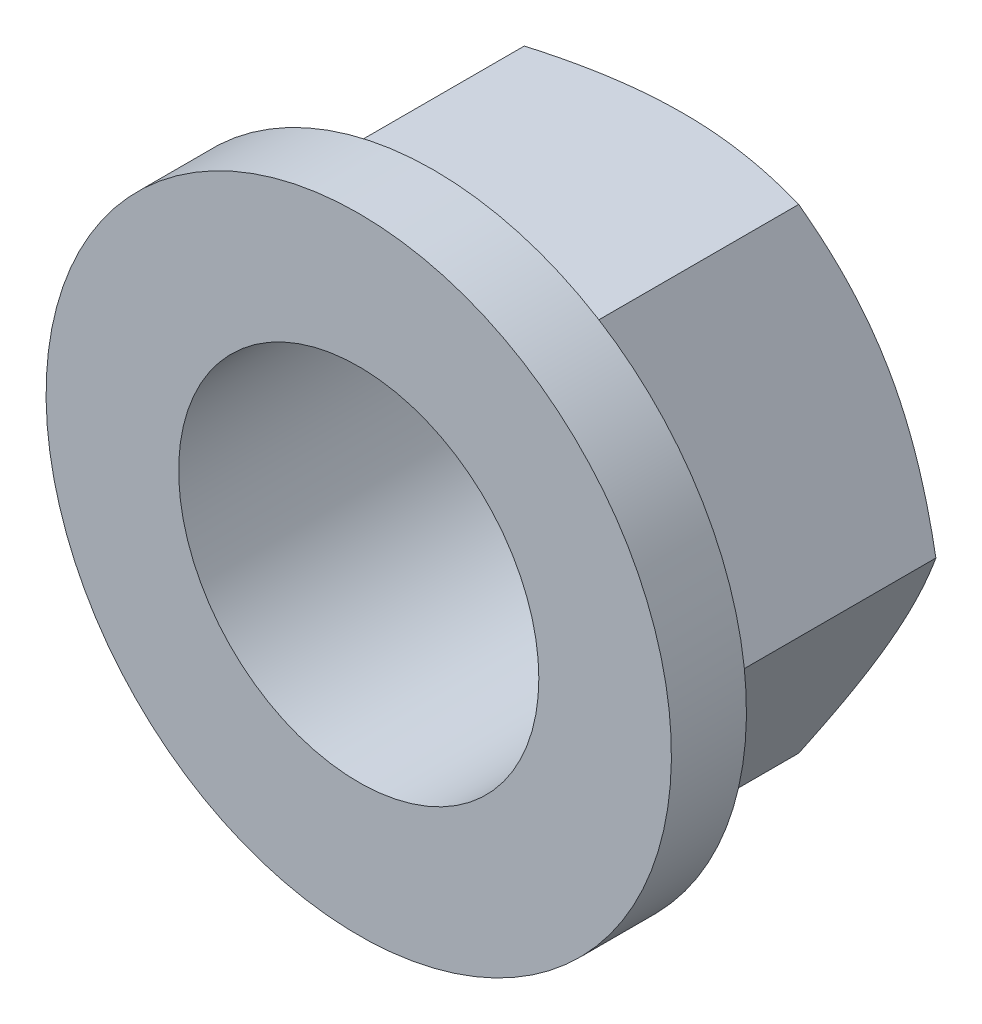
ISO-10303-21;
HEADER;
FILE_DESCRIPTION(('STEP AP214'),'2;1');
FILE_NAME('part.step','',(''),(''),'','','');
FILE_SCHEMA(('AUTOMOTIVE_DESIGN { 1 0 10303 214 1 1 1 1 }'));
ENDSEC;
DATA;
#1=APPLICATION_CONTEXT('core data for automotive mechanical design processes');
#2=APPLICATION_PROTOCOL_DEFINITION('international standard','automotive_design',2000,#1);
#3=PRODUCT_CONTEXT('',#1,'mechanical');
#4=PRODUCT('Part','Part','',(#3));
#5=PRODUCT_RELATED_PRODUCT_CATEGORY('part','',(#4));
#6=PRODUCT_DEFINITION_FORMATION('','',#4);
#7=PRODUCT_DEFINITION_CONTEXT('part definition',#1,'design');
#8=PRODUCT_DEFINITION('design','',#6,#7);
#9=PRODUCT_DEFINITION_SHAPE('','',#8);
#10=(LENGTH_UNIT() NAMED_UNIT(*) SI_UNIT(.MILLI.,.METRE.));
#11=(NAMED_UNIT(*) PLANE_ANGLE_UNIT() SI_UNIT($,.RADIAN.));
#12=(NAMED_UNIT(*) SI_UNIT($,.STERADIAN.) SOLID_ANGLE_UNIT());
#13=UNCERTAINTY_MEASURE_WITH_UNIT(LENGTH_MEASURE(1.E-05),#10,'distance_accuracy_value','');
#14=(GEOMETRIC_REPRESENTATION_CONTEXT(3) GLOBAL_UNCERTAINTY_ASSIGNED_CONTEXT((#13)) GLOBAL_UNIT_ASSIGNED_CONTEXT((#10,
#11,#12)) REPRESENTATION_CONTEXT('',''));
#15=CARTESIAN_POINT('',(0.,0.,0.));
#16=DIRECTION('',(0.,0.,1.));
#17=DIRECTION('',(1.,0.,0.));
#18=AXIS2_PLACEMENT_3D('',#15,#16,#17);
#19=CARTESIAN_POINT('',(0.,0.,4.55149422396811));
#20=DIRECTION('',(0.,0.,-1.));
#21=DIRECTION('',(0.,1.,0.));
#22=AXIS2_PLACEMENT_3D('',#19,#20,#21);
#23=PLANE('',#22);
#24=CARTESIAN_POINT('',(0.,0.,4.55149422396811));
#25=DIRECTION('',(0.,0.,-1.));
#26=DIRECTION('',(0.,1.,0.));
#27=AXIS2_PLACEMENT_3D('',#24,#25,#26);
#28=CIRCLE('',#27,12.5);
#29=CARTESIAN_POINT('',(0.,12.5,4.55149422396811));
#30=VERTEX_POINT('',#29);
#31=EDGE_CURVE('E256',#30,#30,#28,.T.);
#32=ORIENTED_EDGE('',*,*,#31,.T.);
#33=EDGE_LOOP('',(#32));
#34=FACE_BOUND('',#33,.T.);
#35=DIRECTION('',(-1.,0.,0.));
#36=VECTOR('',#35,1.);
#37=CARTESIAN_POINT('',(-5.48482755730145,-9.5,4.55149422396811));
#38=LINE('',#37,#36);
#39=CARTESIAN_POINT('',(5.48482755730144,-9.50000000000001,4.55149422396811));
#40=VERTEX_POINT('',#39);
#41=CARTESIAN_POINT('',(-5.48482755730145,-9.5,4.55149422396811));
#42=VERTEX_POINT('',#41);
#43=EDGE_CURVE('E227',#40,#42,#38,.T.);
#44=ORIENTED_EDGE('',*,*,#43,.F.);
#45=DIRECTION('',(-0.5,-0.866025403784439,0.));
#46=VECTOR('',#45,1.);
#47=CARTESIAN_POINT('',(5.48482755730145,-9.50000000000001,4.55149422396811));
#48=LINE('',#47,#46);
#49=CARTESIAN_POINT('',(10.9696551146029,0.,4.55149422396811));
#50=VERTEX_POINT('',#49);
#51=EDGE_CURVE('E267',#50,#40,#48,.T.);
#52=ORIENTED_EDGE('',*,*,#51,.F.);
#53=DIRECTION('',(0.5,-0.866025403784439,0.));
#54=VECTOR('',#53,1.);
#55=CARTESIAN_POINT('',(10.9696551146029,0.,4.55149422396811));
#56=LINE('',#55,#54);
#57=CARTESIAN_POINT('',(5.48482755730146,9.5,4.55149422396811));
#58=VERTEX_POINT('',#57);
#59=EDGE_CURVE('E112',#58,#50,#56,.T.);
#60=ORIENTED_EDGE('',*,*,#59,.F.);
#61=DIRECTION('',(1.,0.,0.));
#62=VECTOR('',#61,1.);
#63=CARTESIAN_POINT('',(5.48482755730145,9.5,4.55149422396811));
#64=LINE('',#63,#62);
#65=CARTESIAN_POINT('',(-5.48482755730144,9.50000000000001,4.55149422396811));
#66=VERTEX_POINT('',#65);
#67=EDGE_CURVE('E107',#66,#58,#64,.T.);
#68=ORIENTED_EDGE('',*,*,#67,.F.);
#69=DIRECTION('',(0.5,0.866025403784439,0.));
#70=VECTOR('',#69,1.);
#71=CARTESIAN_POINT('',(-5.48482755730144,9.5,4.55149422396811));
#72=LINE('',#71,#70);
#73=CARTESIAN_POINT('',(-10.9696551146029,0.,4.55149422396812));
#74=VERTEX_POINT('',#73);
#75=EDGE_CURVE('E109',#74,#66,#72,.T.);
#76=ORIENTED_EDGE('',*,*,#75,.F.);
#77=DIRECTION('',(-0.499999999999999,0.86602540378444,0.));
#78=VECTOR('',#77,1.);
#79=CARTESIAN_POINT('',(-10.9696551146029,0.,4.55149422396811));
#80=LINE('',#79,#78);
#81=EDGE_CURVE('E124',#42,#74,#80,.T.);
#82=ORIENTED_EDGE('',*,*,#81,.F.);
#83=EDGE_LOOP('',(#44,#52,#60,#68,#76,#82));
#84=FACE_BOUND('',#83,.T.);
#85=ADVANCED_FACE('F32',(#34,#84),#23,.T.);
#86=CARTESIAN_POINT('',(0.,0.,0.));
#87=DIRECTION('',(0.,0.,-1.));
#88=DIRECTION('',(0.,1.,0.));
#89=AXIS2_PLACEMENT_3D('',#86,#87,#88);
#90=CYLINDRICAL_SURFACE('',#89,12.5);
#91=CARTESIAN_POINT('',(0.,0.,7.55149422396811));
#92=DIRECTION('',(0.,0.,-1.));
#93=DIRECTION('',(0.,1.,0.));
#94=AXIS2_PLACEMENT_3D('',#91,#92,#93);
#95=CIRCLE('',#94,12.5);
#96=CARTESIAN_POINT('',(0.,12.5,7.55149422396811));
#97=VERTEX_POINT('',#96);
#98=EDGE_CURVE('E258',#97,#97,#95,.T.);
#99=ORIENTED_EDGE('',*,*,#98,.T.);
#100=EDGE_LOOP('',(#99));
#101=FACE_BOUND('',#100,.T.);
#102=ORIENTED_EDGE('',*,*,#31,.F.);
#103=EDGE_LOOP('',(#102));
#104=FACE_BOUND('',#103,.T.);
#105=ADVANCED_FACE('F247',(#101,#104),#90,.T.);
#106=CARTESIAN_POINT('',(0.,0.,7.55149422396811));
#107=DIRECTION('',(0.,0.,1.));
#108=DIRECTION('',(0.,-1.,0.));
#109=AXIS2_PLACEMENT_3D('',#106,#107,#108);
#110=PLANE('',#109);
#111=CARTESIAN_POINT('',(0.,0.,7.55149422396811));
#112=DIRECTION('',(0.,0.,-1.));
#113=DIRECTION('',(0.,1.,0.));
#114=AXIS2_PLACEMENT_3D('',#111,#112,#113);
#115=CIRCLE('',#114,7.2);
#116=CARTESIAN_POINT('',(7.2,0.,7.55149422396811));
#117=VERTEX_POINT('',#116);
#118=EDGE_CURVE('E262',#117,#117,#115,.T.);
#119=ORIENTED_EDGE('',*,*,#118,.T.);
#120=EDGE_LOOP('',(#119));
#121=FACE_BOUND('',#120,.T.);
#122=ORIENTED_EDGE('',*,*,#98,.F.);
#123=EDGE_LOOP('',(#122));
#124=FACE_BOUND('',#123,.T.);
#125=ADVANCED_FACE('F252',(#121,#124),#110,.T.);
#126=CARTESIAN_POINT('',(-5.48482755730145,-9.5,5.4));
#127=DIRECTION('',(0.,1.,0.));
#128=DIRECTION('',(-1.,0.,0.));
#129=AXIS2_PLACEMENT_3D('',#126,#127,#128);
#130=PLANE('',#129);
#131=DIRECTION('',(0.,0.,-1.));
#132=VECTOR('',#131,1.);
#133=CARTESIAN_POINT('',(5.48482755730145,-9.50000000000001,5.4));
#134=LINE('',#133,#132);
#135=CARTESIAN_POINT('',(5.48482755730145,-9.50000000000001,-4.55149422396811));
#136=VERTEX_POINT('',#135);
#137=EDGE_CURVE('E138',#40,#136,#134,.T.);
#138=ORIENTED_EDGE('',*,*,#137,.F.);
#139=ORIENTED_EDGE('',*,*,#43,.T.);
#140=DIRECTION('',(0.,0.,-1.));
#141=VECTOR('',#140,1.);
#142=CARTESIAN_POINT('',(-5.48482755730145,-9.5,5.4));
#143=LINE('',#142,#141);
#144=CARTESIAN_POINT('',(-5.48482755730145,-9.5,-4.55149422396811));
#145=VERTEX_POINT('',#144);
#146=EDGE_CURVE('E134',#42,#145,#143,.T.);
#147=ORIENTED_EDGE('',*,*,#146,.T.);
#148=CARTESIAN_POINT('',(-14.8049501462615,-9.5,-0.728769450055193));
#149=CARTESIAN_POINT('',(-14.5971224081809,-9.5,-0.829754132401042));
#150=CARTESIAN_POINT('',(-14.3890526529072,-9.5,-0.930240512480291));
#151=CARTESIAN_POINT('',(-13.972378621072,-9.5,-1.13010390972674));
#152=CARTESIAN_POINT('',(-13.7637743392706,-9.5,-1.22948091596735));
#153=CARTESIAN_POINT('',(-13.137029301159,-9.5,-1.52580451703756));
#154=CARTESIAN_POINT('',(-12.7180168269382,-9.5,-1.72091422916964));
#155=CARTESIAN_POINT('',(-11.8749660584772,-9.5,-2.10610260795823));
#156=CARTESIAN_POINT('',(-11.4509128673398,-9.5,-2.29614874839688));
#157=CARTESIAN_POINT('',(-10.5994579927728,-9.5,-2.66855813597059));
#158=CARTESIAN_POINT('',(-10.1720564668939,-9.5,-2.85092174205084));
#159=CARTESIAN_POINT('',(-9.29943063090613,-9.5,-3.21163611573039));
#160=CARTESIAN_POINT('',(-8.85407465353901,-9.5,-3.38967008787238));
#161=CARTESIAN_POINT('',(-7.95818102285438,-9.5,-3.73243755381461));
#162=CARTESIAN_POINT('',(-7.50764279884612,-9.5,-3.89716956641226));
#163=CARTESIAN_POINT('',(-6.60148114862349,-9.5,-4.20906262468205));
#164=CARTESIAN_POINT('',(-6.14586985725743,-9.5,-4.35625855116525));
#165=CARTESIAN_POINT('',(-5.22812993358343,-9.5,-4.62840704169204));
#166=CARTESIAN_POINT('',(-4.76600337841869,-9.5,-4.75336652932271));
#167=CARTESIAN_POINT('',(-3.83733165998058,-9.5,-4.97445367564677));
#168=CARTESIAN_POINT('',(-3.37082333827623,-9.5,-5.07073193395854));
#169=CARTESIAN_POINT('',(-2.66675724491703,-9.5,-5.18947504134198));
#170=CARTESIAN_POINT('',(-2.43133539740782,-9.5,-5.22477853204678));
#171=CARTESIAN_POINT('',(-1.95929718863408,-9.5,-5.28613694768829));
#172=CARTESIAN_POINT('',(-1.7226809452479,-9.5,-5.31219276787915));
#173=CARTESIAN_POINT('',(-1.25169433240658,-9.5,-5.35420608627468));
#174=CARTESIAN_POINT('',(-1.0173354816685,-9.5,-5.37029219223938));
#175=CARTESIAN_POINT('',(-0.54814733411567,-9.5,-5.39253570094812));
#176=CARTESIAN_POINT('',(-0.313318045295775,-9.5,-5.39869327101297));
#177=CARTESIAN_POINT('',(0.156394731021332,-9.5,-5.40093259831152));
#178=CARTESIAN_POINT('',(0.39127821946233,-9.5,-5.39701416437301));
#179=CARTESIAN_POINT('',(0.860669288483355,-9.5,-5.37919786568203));
#180=CARTESIAN_POINT('',(1.09517685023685,-9.5,-5.36529951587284));
#181=CARTESIAN_POINT('',(1.65637532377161,-9.5,-5.32039375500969));
#182=CARTESIAN_POINT('',(1.98270598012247,-9.5,-5.28478477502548));
#183=CARTESIAN_POINT('',(2.63297891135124,-9.5,-5.19616585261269));
#184=CARTESIAN_POINT('',(2.95692086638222,-9.50000000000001,-5.14315362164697));
#185=CARTESIAN_POINT('',(3.92475322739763,-9.50000000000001,-4.96082113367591));
#186=CARTESIAN_POINT('',(4.56432034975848,-9.50000000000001,-4.80823498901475));
#187=CARTESIAN_POINT('',(5.52118771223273,-9.50000000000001,-4.54309734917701));
#188=CARTESIAN_POINT('',(5.84342968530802,-9.50000000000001,-4.44735198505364));
#189=CARTESIAN_POINT('',(6.48478280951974,-9.50000000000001,-4.24579973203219));
#190=CARTESIAN_POINT('',(6.80389393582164,-9.50000000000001,-4.13999276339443));
#191=CARTESIAN_POINT('',(7.43909000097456,-9.50000000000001,-3.9200235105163));
#192=CARTESIAN_POINT('',(7.75517580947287,-9.50000000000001,-3.80586371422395));
#193=CARTESIAN_POINT('',(8.3847172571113,-9.50000000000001,-3.57055053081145));
#194=CARTESIAN_POINT('',(8.69817296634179,-9.50000000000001,-3.44939733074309));
#195=CARTESIAN_POINT('',(9.2971233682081,-9.50000000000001,-3.21142655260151));
#196=CARTESIAN_POINT('',(9.58280159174,-9.50000000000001,-3.09506914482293));
#197=CARTESIAN_POINT('',(10.1524130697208,-9.50000000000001,-2.85815255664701));
#198=CARTESIAN_POINT('',(10.4363462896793,-9.50000000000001,-2.73759329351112));
#199=CARTESIAN_POINT('',(11.2858827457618,-9.50000000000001,-2.37053441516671));
#200=CARTESIAN_POINT('',(11.8491707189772,-9.50000000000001,-2.1186746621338));
#201=CARTESIAN_POINT('',(12.9711243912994,-9.50000000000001,-1.60430901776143));
#202=CARTESIAN_POINT('',(13.5297879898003,-9.50000000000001,-1.3417985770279));
#203=CARTESIAN_POINT('',(14.6432606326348,-9.50000000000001,-0.808812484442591));
#204=CARTESIAN_POINT('',(15.1980698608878,-9.50000000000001,-0.538337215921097));
#205=CARTESIAN_POINT('',(16.3056023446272,-9.50000000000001,0.00922009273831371));
#206=CARTESIAN_POINT('',(16.8583203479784,-9.50000000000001,0.286312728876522));
#207=CARTESIAN_POINT('',(17.9613153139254,-9.50000000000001,0.845320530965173));
#208=CARTESIAN_POINT('',(18.5115922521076,-9.50000000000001,1.12723574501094));
#209=CARTESIAN_POINT('',(19.6100286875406,-9.50000000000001,1.69482849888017));
#210=CARTESIAN_POINT('',(20.1581886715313,-9.50000000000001,1.9805050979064));
#211=CARTESIAN_POINT('',(21.2528811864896,-9.50000000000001,2.5549515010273));
#212=CARTESIAN_POINT('',(21.7994137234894,-9.50000000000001,2.84372129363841));
#213=CARTESIAN_POINT('',(23.3127333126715,-9.50000000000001,3.64777519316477));
#214=CARTESIAN_POINT('',(24.2780892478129,-9.50000000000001,4.16575214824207));
#215=CARTESIAN_POINT('',(26.2058046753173,-9.50000000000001,5.20740114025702));
#216=CARTESIAN_POINT('',(27.168163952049,-9.50000000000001,5.73107357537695));
#217=CARTESIAN_POINT('',(29.0872357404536,-9.50000000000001,6.78080177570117));
#218=CARTESIAN_POINT('',(30.0439562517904,-9.50000000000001,7.30684292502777));
#219=CARTESIAN_POINT('',(31.4776743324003,-9.50000000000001,8.09827461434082));
#220=CARTESIAN_POINT('',(31.9553330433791,-9.50000000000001,8.36246893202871));
#221=CARTESIAN_POINT('',(32.9102579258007,-9.50000000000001,8.89156487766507));
#222=CARTESIAN_POINT('',(33.3875240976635,-9.50000000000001,9.15646650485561));
#223=CARTESIAN_POINT('',(33.864618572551,-9.50000000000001,9.42167707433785));
#224=B_SPLINE_CURVE_WITH_KNOTS('',3,(#148,#149,#150,#151,#152,#153,#154,#155,#156,#157,#158,
#159,#160,#161,#162,#163,#164,#165,#166,#167,#168,#169,#170,#171,#172,#173,#174,#175,#176,#177,
#178,#179,#180,#181,#182,#183,#184,#185,#186,#187,#188,#189,#190,#191,#192,#193,#194,#195,#196,
#197,#198,#199,#200,#201,#202,#203,#204,#205,#206,#207,#208,#209,#210,#211,#212,#213,#214,#215,
#216,#217,#218,#219,#220,#221,#222,#223),.UNSPECIFIED.,.F.,.F.,(4,2,2,2,2,2,2,2,2,2,2,2,2,2,2,2,
2,2,2,2,2,2,2,2,2,2,2,2,2,2,2,2,2,2,2,2,2,4),(0.,0.693188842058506,1.38638450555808,
2.77297763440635,4.16699402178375,5.56094520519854,6.99964878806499,8.43851235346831,
9.87446433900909,11.3099684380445,12.7377964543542,13.451805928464,14.1657462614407,
14.8702739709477,15.5747898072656,16.279319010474,16.9838824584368,17.9681316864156,
18.9525103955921,20.9222567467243,21.9306662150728,22.9390836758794,23.9472019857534,
24.9552933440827,25.8806526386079,26.8060301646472,28.6569535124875,30.5086759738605,
32.3603094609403,34.2151383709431,36.0699857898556,37.9243777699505,39.7787628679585,
43.0653588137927,46.3521860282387,49.6275859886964,51.2651472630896,52.9027067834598),.UNSPECIFIED.);
#225=CARTESIAN_POINT('',(0.,-9.50000000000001,-5.4));
#226=VERTEX_POINT('',#225);
#227=EDGE_CURVE('E212',#226,#145,#224,.F.);
#228=ORIENTED_EDGE('',*,*,#227,.F.);
#229=EDGE_CURVE('E217',#136,#226,#224,.F.);
#230=ORIENTED_EDGE('',*,*,#229,.F.);
#231=EDGE_LOOP('',(#138,#139,#147,#228,#230));
#232=FACE_BOUND('',#231,.T.);
#233=ADVANCED_FACE('F34',(#232),#130,.F.);
#234=CARTESIAN_POINT('',(5.48482755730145,-9.50000000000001,5.4));
#235=DIRECTION('',(-0.866025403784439,0.5,0.));
#236=DIRECTION('',(-0.5,-0.866025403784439,0.));
#237=AXIS2_PLACEMENT_3D('',#234,#235,#236);
#238=PLANE('',#237);
#239=DIRECTION('',(0.,0.,-1.));
#240=VECTOR('',#239,1.);
#241=CARTESIAN_POINT('',(10.9696551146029,0.,5.4));
#242=LINE('',#241,#240);
#243=CARTESIAN_POINT('',(10.9696551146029,0.,-4.55149422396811));
#244=VERTEX_POINT('',#243);
#245=EDGE_CURVE('E132',#50,#244,#242,.T.);
#246=ORIENTED_EDGE('',*,*,#245,.F.);
#247=ORIENTED_EDGE('',*,*,#51,.T.);
#248=ORIENTED_EDGE('',*,*,#137,.T.);
#249=CARTESIAN_POINT('',(10.9697705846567,0.0002,-4.55142755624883));
#250=CARTESIAN_POINT('',(10.8492020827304,-0.208630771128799,-4.62102656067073));
#251=CARTESIAN_POINT('',(10.7281840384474,-0.418240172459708,-4.68746669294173));
#252=CARTESIAN_POINT('',(10.4851774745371,-0.839139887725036,-4.81315271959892));
#253=CARTESIAN_POINT('',(10.3631886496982,-1.05043073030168,-4.87239624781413));
#254=CARTESIAN_POINT('',(9.99525656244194,-1.68770779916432,-5.03818542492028));
#255=CARTESIAN_POINT('',(9.74786083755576,-2.11620976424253,-5.13248555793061));
#256=CARTESIAN_POINT('',(9.37764446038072,-2.75744333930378,-5.24306129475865));
#257=CARTESIAN_POINT('',(9.2559298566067,-2.96825921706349,-5.27456017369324));
#258=CARTESIAN_POINT('',(9.01193711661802,-3.39086703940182,-5.32738179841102));
#259=CARTESIAN_POINT('',(8.88965896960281,-3.60265900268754,-5.34870434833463));
#260=CARTESIAN_POINT('',(8.64489870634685,-4.0265962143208,-5.38062697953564));
#261=CARTESIAN_POINT('',(8.52241700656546,-4.23874074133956,-5.39123980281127));
#262=CARTESIAN_POINT('',(8.2773404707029,-4.66322575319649,-5.40151746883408));
#263=CARTESIAN_POINT('',(8.15474563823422,-4.87556623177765,-5.40118264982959));
#264=CARTESIAN_POINT('',(7.92555157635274,-5.27254199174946,-5.39032663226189));
#265=CARTESIAN_POINT('',(7.81893617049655,-5.45720529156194,-5.38112973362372));
#266=CARTESIAN_POINT('',(7.6059547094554,-5.82610000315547,-5.35463460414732));
#267=CARTESIAN_POINT('',(7.49958867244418,-6.01033138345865,-5.33733580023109));
#268=CARTESIAN_POINT('',(7.18090270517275,-6.56231167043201,-5.27369551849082));
#269=CARTESIAN_POINT('',(6.96914687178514,-6.92908353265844,-5.21561809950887));
#270=CARTESIAN_POINT('',(6.5433889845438,-7.66651782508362,-5.07042398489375));
#271=CARTESIAN_POINT('',(6.32944126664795,-8.03708614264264,-4.98269183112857));
#272=CARTESIAN_POINT('',(5.90473630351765,-8.77269671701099,-4.78357626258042));
#273=CARTESIAN_POINT('',(5.69397361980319,-9.13774839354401,-4.67223961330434));
#274=CARTESIAN_POINT('',(5.48471208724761,-9.50020000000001,-4.55142755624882));
#275=B_SPLINE_CURVE_WITH_KNOTS('',3,(#249,#250,#251,#252,#253,#254,#255,#256,#257,#258,#259,
#260,#261,#262,#263,#264,#265,#266,#267,#268,#269,#270,#271,#272,#273,#274),.UNSPECIFIED.,.F.,
.F.,(4,2,2,2,2,2,2,2,2,2,2,2,4),(0.,0.752880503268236,1.50600787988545,3.0154687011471,
3.75167336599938,4.48789219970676,5.22323407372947,5.95855322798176,6.59868084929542,
7.23885375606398,8.52010929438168,9.82978009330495,11.1368800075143),.UNSPECIFIED.);
#276=CARTESIAN_POINT('',(8.22724133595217,-4.75,-5.4));
#277=VERTEX_POINT('',#276);
#278=EDGE_CURVE('E155',#277,#136,#275,.T.);
#279=ORIENTED_EDGE('',*,*,#278,.F.);
#280=EDGE_CURVE('E158',#244,#277,#275,.T.);
#281=ORIENTED_EDGE('',*,*,#280,.F.);
#282=EDGE_LOOP('',(#246,#247,#248,#279,#281));
#283=FACE_BOUND('',#282,.T.);
#284=ADVANCED_FACE('F157',(#283),#238,.F.);
#285=CARTESIAN_POINT('',(10.9696551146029,0.,5.4));
#286=DIRECTION('',(-0.866025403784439,-0.5,0.));
#287=DIRECTION('',(0.5,-0.866025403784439,0.));
#288=AXIS2_PLACEMENT_3D('',#285,#286,#287);
#289=PLANE('',#288);
#290=DIRECTION('',(0.,0.,-1.));
#291=VECTOR('',#290,1.);
#292=CARTESIAN_POINT('',(5.48482755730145,9.5,5.4));
#293=LINE('',#292,#291);
#294=CARTESIAN_POINT('',(5.48482755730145,9.5,-4.55149422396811));
#295=VERTEX_POINT('',#294);
#296=EDGE_CURVE('E130',#58,#295,#293,.T.);
#297=ORIENTED_EDGE('',*,*,#296,.F.);
#298=ORIENTED_EDGE('',*,*,#59,.T.);
#299=ORIENTED_EDGE('',*,*,#245,.T.);
#300=CARTESIAN_POINT('',(5.48471208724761,9.5002,-4.55142755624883));
#301=CARTESIAN_POINT('',(5.6052805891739,9.2913692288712,-4.62102656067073));
#302=CARTESIAN_POINT('',(5.72629863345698,9.08175982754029,-4.68746669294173));
#303=CARTESIAN_POINT('',(5.96930519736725,8.66086011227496,-4.81315271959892));
#304=CARTESIAN_POINT('',(6.09129402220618,8.44956926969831,-4.87239624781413));
#305=CARTESIAN_POINT('',(6.4592261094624,7.81229220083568,-5.03818542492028));
#306=CARTESIAN_POINT('',(6.70662183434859,7.38379023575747,-5.13248555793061));
#307=CARTESIAN_POINT('',(7.07683821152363,6.74255666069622,-5.24306129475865));
#308=CARTESIAN_POINT('',(7.19855281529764,6.53174078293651,-5.27456017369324));
#309=CARTESIAN_POINT('',(7.44254555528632,6.10913296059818,-5.32738179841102));
#310=CARTESIAN_POINT('',(7.56482370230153,5.89734099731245,-5.34870434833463));
#311=CARTESIAN_POINT('',(7.80958396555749,5.4734037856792,-5.38062697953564));
#312=CARTESIAN_POINT('',(7.93206566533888,5.26125925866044,-5.39123980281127));
#313=CARTESIAN_POINT('',(8.17714220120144,4.83677424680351,-5.40151746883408));
#314=CARTESIAN_POINT('',(8.29973703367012,4.62443376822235,-5.40118264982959));
#315=CARTESIAN_POINT('',(8.52893109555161,4.22745800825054,-5.39032663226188));
#316=CARTESIAN_POINT('',(8.63554650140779,4.04279470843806,-5.38112973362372));
#317=CARTESIAN_POINT('',(8.84852796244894,3.67389999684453,-5.35463460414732));
#318=CARTESIAN_POINT('',(8.95489399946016,3.48966861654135,-5.33733580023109));
#319=CARTESIAN_POINT('',(9.27357996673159,2.93768832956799,-5.27369551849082));
#320=CARTESIAN_POINT('',(9.4853358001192,2.57091646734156,-5.21561809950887));
#321=CARTESIAN_POINT('',(9.91109368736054,1.83348217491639,-5.07042398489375));
#322=CARTESIAN_POINT('',(10.1250414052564,1.46291385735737,-4.98269183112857));
#323=CARTESIAN_POINT('',(10.5497463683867,0.727303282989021,-4.78357626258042));
#324=CARTESIAN_POINT('',(10.7605090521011,0.362251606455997,-4.67223961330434));
#325=CARTESIAN_POINT('',(10.9697705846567,-0.000199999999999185,-4.55142755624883));
#326=B_SPLINE_CURVE_WITH_KNOTS('',3,(#300,#301,#302,#303,#304,#305,#306,#307,#308,#309,#310,
#311,#312,#313,#314,#315,#316,#317,#318,#319,#320,#321,#322,#323,#324,#325),.UNSPECIFIED.,.F.,
.F.,(4,2,2,2,2,2,2,2,2,2,2,2,4),(0.,0.752880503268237,1.50600787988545,3.0154687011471,
3.75167336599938,4.48789219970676,5.22323407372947,5.95855322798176,6.59868084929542,
7.23885375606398,8.52010929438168,9.82978009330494,11.1368800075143),.UNSPECIFIED.);
#327=CARTESIAN_POINT('',(8.22724133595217,4.75,-5.4));
#328=VERTEX_POINT('',#327);
#329=EDGE_CURVE('E175',#328,#244,#326,.T.);
#330=ORIENTED_EDGE('',*,*,#329,.F.);
#331=EDGE_CURVE('E226',#295,#328,#326,.T.);
#332=ORIENTED_EDGE('',*,*,#331,.F.);
#333=EDGE_LOOP('',(#297,#298,#299,#330,#332));
#334=FACE_BOUND('',#333,.T.);
#335=ADVANCED_FACE('F270',(#334),#289,.F.);
#336=CARTESIAN_POINT('',(5.48482755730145,9.5,5.4));
#337=DIRECTION('',(0.,-1.,0.));
#338=DIRECTION('',(1.,0.,0.));
#339=AXIS2_PLACEMENT_3D('',#336,#337,#338);
#340=PLANE('',#339);
#341=DIRECTION('',(0.,0.,-1.));
#342=VECTOR('',#341,1.);
#343=CARTESIAN_POINT('',(-5.48482755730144,9.5,5.4));
#344=LINE('',#343,#342);
#345=CARTESIAN_POINT('',(-5.48482755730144,9.5,-4.55149422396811));
#346=VERTEX_POINT('',#345);
#347=EDGE_CURVE('E121',#66,#346,#344,.T.);
#348=ORIENTED_EDGE('',*,*,#347,.F.);
#349=ORIENTED_EDGE('',*,*,#67,.T.);
#350=ORIENTED_EDGE('',*,*,#296,.T.);
#351=CARTESIAN_POINT('',(-14.8049501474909,9.50000000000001,-0.728769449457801));
#352=CARTESIAN_POINT('',(-14.5971224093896,9.50000000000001,-0.829754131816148));
#353=CARTESIAN_POINT('',(-14.3890526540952,9.50000000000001,-0.930240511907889));
#354=CARTESIAN_POINT('',(-13.9723786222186,9.50000000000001,-1.13010390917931));
#355=CARTESIAN_POINT('',(-13.7637743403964,9.5,-1.22948091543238));
#356=CARTESIAN_POINT('',(-13.1370293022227,9.5,-1.52580451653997));
#357=CARTESIAN_POINT('',(-12.7180168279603,9.5,-1.72091422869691));
#358=CARTESIAN_POINT('',(-11.8749660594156,9.5,-2.10610260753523));
#359=CARTESIAN_POINT('',(-11.450912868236,9.5,-2.29614874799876));
#360=CARTESIAN_POINT('',(-10.5994579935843,9.5,-2.66855813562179));
#361=CARTESIAN_POINT('',(-10.1720564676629,9.5,-2.85092174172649));
#362=CARTESIAN_POINT('',(-9.29943063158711,9.5,-3.21163611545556));
#363=CARTESIAN_POINT('',(-8.85407465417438,9.5,-3.38967008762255));
#364=CARTESIAN_POINT('',(-7.95818102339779,9.5,-3.73243755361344));
#365=CARTESIAN_POINT('',(-7.50764279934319,9.5,-3.89716956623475));
#366=CARTESIAN_POINT('',(-6.60148114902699,9.5,-4.20906262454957));
#367=CARTESIAN_POINT('',(-6.14586985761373,9.5,-4.35625855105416));
#368=CARTESIAN_POINT('',(-5.22812993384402,9.5,-4.6284070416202));
#369=CARTESIAN_POINT('',(-4.76600337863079,9.5,-4.75336652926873));
#370=CARTESIAN_POINT('',(-3.8373316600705,9.5,-4.97445367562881));
#371=CARTESIAN_POINT('',(-3.37082333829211,9.5,-5.07073193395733));
#372=CARTESIAN_POINT('',(-2.66675724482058,9.5,-5.18947504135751));
#373=CARTESIAN_POINT('',(-2.43133539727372,9.5,-5.2247785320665));
#374=CARTESIAN_POINT('',(-1.95929718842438,9.5,-5.28613694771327));
#375=CARTESIAN_POINT('',(-1.72268094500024,9.5,-5.31219276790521));
#376=CARTESIAN_POINT('',(-1.25169433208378,9.5,-5.35420608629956));
#377=CARTESIAN_POINT('',(-1.01733548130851,9.5,-5.37029219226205));
#378=CARTESIAN_POINT('',(-0.548147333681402,9.5,-5.3925357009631));
#379=CARTESIAN_POINT('',(-0.313318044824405,9.5,-5.39869327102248));
#380=CARTESIAN_POINT('',(0.156394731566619,9.5,-5.40093259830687));
#381=CARTESIAN_POINT('',(0.391278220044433,9.5,-5.39701416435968));
#382=CARTESIAN_POINT('',(0.86066928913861,9.5,-5.3791978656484));
#383=CARTESIAN_POINT('',(1.09517685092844,9.5,-5.36529951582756));
#384=CARTESIAN_POINT('',(1.65637532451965,9.5,-5.32039375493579));
#385=CARTESIAN_POINT('',(1.98270598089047,9.5,-5.28478477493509));
#386=CARTESIAN_POINT('',(2.63297891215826,9.5,-5.19616585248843));
#387=CARTESIAN_POINT('',(2.95692086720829,9.5,-5.14315362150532));
#388=CARTESIAN_POINT('',(3.92475322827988,9.5,-4.96082113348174));
#389=CARTESIAN_POINT('',(4.56432035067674,9.5,-4.80823498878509));
#390=CARTESIAN_POINT('',(5.52118771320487,9.5,-4.54309734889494));
#391=CARTESIAN_POINT('',(5.84342968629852,9.5,-4.44735198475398));
#392=CARTESIAN_POINT('',(6.48478281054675,9.5,-4.24579973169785));
#393=CARTESIAN_POINT('',(6.80389393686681,9.5,-4.139992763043));
#394=CARTESIAN_POINT('',(7.4390900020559,9.5,-3.92002351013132));
#395=CARTESIAN_POINT('',(7.75517581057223,9.5,-3.80586371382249));
#396=CARTESIAN_POINT('',(8.38471725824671,9.5,-3.5705505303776));
#397=CARTESIAN_POINT('',(8.69817296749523,9.5,-3.44939733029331));
#398=CARTESIAN_POINT('',(9.2971233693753,9.5,-3.21142655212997));
#399=CARTESIAN_POINT('',(9.58280159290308,9.5,-3.09506914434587));
#400=CARTESIAN_POINT('',(10.152413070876,9.5,-2.85815255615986));
#401=CARTESIAN_POINT('',(10.4363462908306,9.5,-2.73759329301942));
#402=CARTESIAN_POINT('',(11.285882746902,9.5,-2.3705344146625));
#403=CARTESIAN_POINT('',(11.8491707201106,9.5,-2.11867466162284));
#404=CARTESIAN_POINT('',(12.9711243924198,9.5,-1.60430901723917));
#405=CARTESIAN_POINT('',(13.5297879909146,9.49999999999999,-1.3417985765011));
#406=CARTESIAN_POINT('',(14.6432606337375,9.49999999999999,-0.80881248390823));
#407=CARTESIAN_POINT('',(15.198069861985,9.49999999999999,-0.538337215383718));
#408=CARTESIAN_POINT('',(16.3056023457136,9.49999999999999,0.0092200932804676));
#409=CARTESIAN_POINT('',(16.8583203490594,9.49999999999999,0.286312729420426));
#410=CARTESIAN_POINT('',(17.9613153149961,9.49999999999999,0.845320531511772));
#411=CARTESIAN_POINT('',(18.5115922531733,9.49999999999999,1.12723574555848));
#412=CARTESIAN_POINT('',(19.6100286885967,9.49999999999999,1.69482849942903));
#413=CARTESIAN_POINT('',(20.1581886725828,9.49999999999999,1.98050509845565));
#414=CARTESIAN_POINT('',(21.252881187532,9.49999999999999,2.55495150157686));
#415=CARTESIAN_POINT('',(21.7994137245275,9.49999999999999,2.8437212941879));
#416=CARTESIAN_POINT('',(23.3127333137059,9.49999999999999,3.647775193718));
#417=CARTESIAN_POINT('',(24.2780892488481,9.49999999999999,4.16575214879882));
#418=CARTESIAN_POINT('',(26.2058046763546,9.49999999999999,5.20740114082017));
#419=CARTESIAN_POINT('',(27.1681639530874,9.49999999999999,5.73107357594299));
#420=CARTESIAN_POINT('',(29.0872357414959,9.49999999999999,6.78080177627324));
#421=CARTESIAN_POINT('',(30.0439562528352,9.49999999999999,7.30684292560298));
#422=CARTESIAN_POINT('',(31.4776743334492,9.49999999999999,8.09827461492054));
#423=CARTESIAN_POINT('',(31.9553330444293,9.49999999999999,8.36246893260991));
#424=CARTESIAN_POINT('',(32.9102579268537,9.49999999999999,8.89156487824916));
#425=CARTESIAN_POINT('',(33.3875240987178,9.49999999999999,9.15646650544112));
#426=CARTESIAN_POINT('',(33.8646185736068,9.49999999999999,9.42167707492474));
#427=B_SPLINE_CURVE_WITH_KNOTS('',3,(#351,#352,#353,#354,#355,#356,#357,#358,#359,#360,#361,
#362,#363,#364,#365,#366,#367,#368,#369,#370,#371,#372,#373,#374,#375,#376,#377,#378,#379,#380,
#381,#382,#383,#384,#385,#386,#387,#388,#389,#390,#391,#392,#393,#394,#395,#396,#397,#398,#399,
#400,#401,#402,#403,#404,#405,#406,#407,#408,#409,#410,#411,#412,#413,#414,#415,#416,#417,#418,
#419,#420,#421,#422,#423,#424,#425,#426),.UNSPECIFIED.,.F.,.F.,(4,2,2,2,2,2,2,2,2,2,2,2,2,2,2,2,
2,2,2,2,2,2,2,2,2,2,2,2,2,2,2,2,2,2,2,2,2,4),(0.,0.693188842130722,1.38638450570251,
2.77297763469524,4.16699402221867,5.56094520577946,6.99964878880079,8.43851235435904,
9.87446434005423,11.3099684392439,12.7377964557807,13.451805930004,14.1657462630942,
14.8702739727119,15.5747898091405,16.2793190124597,16.9838824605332,17.9681316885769,
18.9525103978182,20.9222567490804,21.9306662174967,22.9390836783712,23.9472019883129,
24.9552933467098,25.8806526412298,26.806030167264,28.6569535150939,30.508675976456,
32.3603094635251,34.2151383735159,36.0699857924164,37.9243777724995,39.7787628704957,
43.0653588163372,46.3521860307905,49.6275859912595,51.2651472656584,52.9027067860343),.UNSPECIFIED.);
#428=CARTESIAN_POINT('',(0.,9.50000000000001,-5.4));
#429=VERTEX_POINT('',#428);
#430=EDGE_CURVE('E162',#429,#295,#427,.T.);
#431=ORIENTED_EDGE('',*,*,#430,.F.);
#432=EDGE_CURVE('E129',#346,#429,#427,.T.);
#433=ORIENTED_EDGE('',*,*,#432,.F.);
#434=EDGE_LOOP('',(#348,#349,#350,#431,#433));
#435=FACE_BOUND('',#434,.T.);
#436=ADVANCED_FACE('F127',(#435),#340,.F.);
#437=CARTESIAN_POINT('',(-5.48482755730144,9.5,5.4));
#438=DIRECTION('',(0.866025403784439,-0.5,0.));
#439=DIRECTION('',(0.5,0.866025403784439,0.));
#440=AXIS2_PLACEMENT_3D('',#437,#438,#439);
#441=PLANE('',#440);
#442=DIRECTION('',(0.,0.,-1.));
#443=VECTOR('',#442,1.);
#444=CARTESIAN_POINT('',(-10.9696551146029,0.,5.4));
#445=LINE('',#444,#443);
#446=CARTESIAN_POINT('',(-10.9696551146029,0.,-4.55149422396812));
#447=VERTEX_POINT('',#446);
#448=EDGE_CURVE('E123',#74,#447,#445,.T.);
#449=ORIENTED_EDGE('',*,*,#448,.F.);
#450=ORIENTED_EDGE('',*,*,#75,.T.);
#451=ORIENTED_EDGE('',*,*,#347,.T.);
#452=CARTESIAN_POINT('',(-10.9697705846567,-0.000199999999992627,-4.55142755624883));
#453=CARTESIAN_POINT('',(-10.8492020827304,0.208630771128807,-4.62102656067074));
#454=CARTESIAN_POINT('',(-10.7281840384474,0.418240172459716,-4.68746669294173));
#455=CARTESIAN_POINT('',(-10.4851774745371,0.839139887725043,-4.81315271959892));
#456=CARTESIAN_POINT('',(-10.3631886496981,1.05043073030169,-4.87239624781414));
#457=CARTESIAN_POINT('',(-9.99525656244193,1.68770779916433,-5.03818542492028));
#458=CARTESIAN_POINT('',(-9.74786083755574,2.11620976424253,-5.13248555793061));
#459=CARTESIAN_POINT('',(-9.37764446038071,2.75744333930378,-5.24306129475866));
#460=CARTESIAN_POINT('',(-9.25592985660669,2.9682592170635,-5.27456017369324));
#461=CARTESIAN_POINT('',(-9.01193711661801,3.39086703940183,-5.32738179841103));
#462=CARTESIAN_POINT('',(-8.8896589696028,3.60265900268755,-5.34870434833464));
#463=CARTESIAN_POINT('',(-8.64489870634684,4.0265962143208,-5.38062697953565));
#464=CARTESIAN_POINT('',(-8.52241700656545,4.23874074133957,-5.39123980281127));
#465=CARTESIAN_POINT('',(-8.2773404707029,4.66322575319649,-5.40151746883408));
#466=CARTESIAN_POINT('',(-8.15474563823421,4.87556623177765,-5.40118264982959));
#467=CARTESIAN_POINT('',(-7.92555157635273,5.27254199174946,-5.39032663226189));
#468=CARTESIAN_POINT('',(-7.81893617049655,5.45720529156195,-5.38112973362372));
#469=CARTESIAN_POINT('',(-7.6059547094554,5.82610000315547,-5.35463460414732));
#470=CARTESIAN_POINT('',(-7.49958867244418,6.01033138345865,-5.33733580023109));
#471=CARTESIAN_POINT('',(-7.18090270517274,6.56231167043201,-5.27369551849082));
#472=CARTESIAN_POINT('',(-6.96914687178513,6.92908353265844,-5.21561809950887));
#473=CARTESIAN_POINT('',(-6.5433889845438,7.66651782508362,-5.07042398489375));
#474=CARTESIAN_POINT('',(-6.32944126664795,8.03708614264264,-4.98269183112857));
#475=CARTESIAN_POINT('',(-5.90473630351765,8.77269671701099,-4.78357626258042));
#476=CARTESIAN_POINT('',(-5.69397361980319,9.13774839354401,-4.67223961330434));
#477=CARTESIAN_POINT('',(-5.4847120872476,9.5002,-4.55142755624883));
#478=B_SPLINE_CURVE_WITH_KNOTS('',3,(#452,#453,#454,#455,#456,#457,#458,#459,#460,#461,#462,
#463,#464,#465,#466,#467,#468,#469,#470,#471,#472,#473,#474,#475,#476,#477),.UNSPECIFIED.,.F.,
.F.,(4,2,2,2,2,2,2,2,2,2,2,2,4),(0.,0.752880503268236,1.50600787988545,3.0154687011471,
3.75167336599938,4.48789219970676,5.22323407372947,5.95855322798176,6.59868084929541,
7.23885375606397,8.52010929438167,9.82978009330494,11.1368800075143),.UNSPECIFIED.);
#479=CARTESIAN_POINT('',(-8.22724133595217,4.75,-5.4));
#480=VERTEX_POINT('',#479);
#481=EDGE_CURVE('E163',#480,#346,#478,.T.);
#482=ORIENTED_EDGE('',*,*,#481,.F.);
#483=EDGE_CURVE('E206',#447,#480,#478,.T.);
#484=ORIENTED_EDGE('',*,*,#483,.F.);
#485=EDGE_LOOP('',(#449,#450,#451,#482,#484));
#486=FACE_BOUND('',#485,.T.);
#487=ADVANCED_FACE('F119',(#486),#441,.F.);
#488=CARTESIAN_POINT('',(-10.9696551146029,0.,5.4));
#489=DIRECTION('',(0.866025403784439,0.499999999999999,0.));
#490=DIRECTION('',(-0.499999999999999,0.86602540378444,0.));
#491=AXIS2_PLACEMENT_3D('',#488,#489,#490);
#492=PLANE('',#491);
#493=ORIENTED_EDGE('',*,*,#146,.F.);
#494=ORIENTED_EDGE('',*,*,#81,.T.);
#495=ORIENTED_EDGE('',*,*,#448,.T.);
#496=CARTESIAN_POINT('',(-5.48471208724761,-9.5002,-4.55142755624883));
#497=CARTESIAN_POINT('',(-5.6052805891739,-9.2913692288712,-4.62102656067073));
#498=CARTESIAN_POINT('',(-5.72629863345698,-9.08175982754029,-4.68746669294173));
#499=CARTESIAN_POINT('',(-5.96930519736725,-8.66086011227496,-4.81315271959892));
#500=CARTESIAN_POINT('',(-6.09129402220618,-8.44956926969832,-4.87239624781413));
#501=CARTESIAN_POINT('',(-6.4592261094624,-7.81229220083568,-5.03818542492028));
#502=CARTESIAN_POINT('',(-6.70662183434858,-7.38379023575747,-5.13248555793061));
#503=CARTESIAN_POINT('',(-7.07683821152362,-6.74255666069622,-5.24306129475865));
#504=CARTESIAN_POINT('',(-7.19855281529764,-6.53174078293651,-5.27456017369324));
#505=CARTESIAN_POINT('',(-7.44254555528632,-6.10913296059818,-5.32738179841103));
#506=CARTESIAN_POINT('',(-7.56482370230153,-5.89734099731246,-5.34870434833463));
#507=CARTESIAN_POINT('',(-7.80958396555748,-5.4734037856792,-5.38062697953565));
#508=CARTESIAN_POINT('',(-7.93206566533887,-5.26125925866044,-5.39123980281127));
#509=CARTESIAN_POINT('',(-8.17714220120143,-4.83677424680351,-5.40151746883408));
#510=CARTESIAN_POINT('',(-8.29973703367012,-4.62443376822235,-5.4011826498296));
#511=CARTESIAN_POINT('',(-8.5289310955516,-4.22745800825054,-5.39032663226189));
#512=CARTESIAN_POINT('',(-8.63554650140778,-4.04279470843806,-5.38112973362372));
#513=CARTESIAN_POINT('',(-8.84852796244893,-3.67389999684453,-5.35463460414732));
#514=CARTESIAN_POINT('',(-8.95489399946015,-3.48966861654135,-5.33733580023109));
#515=CARTESIAN_POINT('',(-9.27357996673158,-2.93768832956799,-5.27369551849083));
#516=CARTESIAN_POINT('',(-9.48533580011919,-2.57091646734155,-5.21561809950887));
#517=CARTESIAN_POINT('',(-9.91109368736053,-1.83348217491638,-5.07042398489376));
#518=CARTESIAN_POINT('',(-10.1250414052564,-1.46291385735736,-4.98269183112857));
#519=CARTESIAN_POINT('',(-10.5497463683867,-0.727303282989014,-4.78357626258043));
#520=CARTESIAN_POINT('',(-10.7605090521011,-0.362251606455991,-4.67223961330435));
#521=CARTESIAN_POINT('',(-10.9697705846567,0.000200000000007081,-4.55142755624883));
#522=B_SPLINE_CURVE_WITH_KNOTS('',3,(#496,#497,#498,#499,#500,#501,#502,#503,#504,#505,#506,
#507,#508,#509,#510,#511,#512,#513,#514,#515,#516,#517,#518,#519,#520,#521),.UNSPECIFIED.,.F.,
.F.,(4,2,2,2,2,2,2,2,2,2,2,2,4),(0.,0.752880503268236,1.50600787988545,3.0154687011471,
3.75167336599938,4.48789219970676,5.22323407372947,5.95855322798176,6.59868084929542,
7.23885375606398,8.52010929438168,9.82978009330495,11.1368800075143),.UNSPECIFIED.);
#523=CARTESIAN_POINT('',(-8.22724133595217,-4.74999999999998,-5.4));
#524=VERTEX_POINT('',#523);
#525=EDGE_CURVE('E197',#524,#447,#522,.T.);
#526=ORIENTED_EDGE('',*,*,#525,.F.);
#527=EDGE_CURVE('E221',#145,#524,#522,.T.);
#528=ORIENTED_EDGE('',*,*,#527,.F.);
#529=EDGE_LOOP('',(#493,#494,#495,#526,#528));
#530=FACE_BOUND('',#529,.T.);
#531=ADVANCED_FACE('F236',(#530),#492,.F.);
#532=CARTESIAN_POINT('',(-5.48482755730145,-9.5,-5.4));
#533=DIRECTION('',(0.,0.,-1.));
#534=DIRECTION('',(-1.,0.,0.));
#535=AXIS2_PLACEMENT_3D('',#532,#533,#534);
#536=PLANE('',#535);
#537=CARTESIAN_POINT('',(0.,0.,-5.4));
#538=DIRECTION('',(0.,0.,1.));
#539=DIRECTION('',(1.,0.,0.));
#540=AXIS2_PLACEMENT_3D('',#537,#538,#539);
#541=CIRCLE('',#540,7.2);
#542=CARTESIAN_POINT('',(7.2,0.,-5.4));
#543=VERTEX_POINT('',#542);
#544=EDGE_CURVE('E228',#543,#543,#541,.T.);
#545=ORIENTED_EDGE('',*,*,#544,.T.);
#546=EDGE_LOOP('',(#545));
#547=FACE_BOUND('',#546,.T.);
#548=CARTESIAN_POINT('',(0.,0.,-5.4));
#549=DIRECTION('',(0.,0.,-1.));
#550=DIRECTION('',(-1.,0.,0.));
#551=AXIS2_PLACEMENT_3D('',#548,#549,#550);
#552=CIRCLE('',#551,9.50000000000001);
#553=EDGE_CURVE('E37',#524,#480,#552,.T.);
#554=ORIENTED_EDGE('',*,*,#553,.T.);
#555=CARTESIAN_POINT('',(0.,0.,-5.4));
#556=DIRECTION('',(0.,0.,-1.));
#557=DIRECTION('',(-1.,0.,0.));
#558=AXIS2_PLACEMENT_3D('',#555,#556,#557);
#559=CIRCLE('',#558,9.50000000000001);
#560=EDGE_CURVE('E49',#480,#429,#559,.T.);
#561=ORIENTED_EDGE('',*,*,#560,.T.);
#562=EDGE_CURVE('E11',#429,#328,#552,.T.);
#563=ORIENTED_EDGE('',*,*,#562,.T.);
#564=EDGE_CURVE('E42',#328,#277,#552,.T.);
#565=ORIENTED_EDGE('',*,*,#564,.T.);
#566=EDGE_CURVE('E144',#277,#226,#552,.T.);
#567=ORIENTED_EDGE('',*,*,#566,.T.);
#568=EDGE_CURVE('E57',#226,#524,#552,.T.);
#569=ORIENTED_EDGE('',*,*,#568,.T.);
#570=EDGE_LOOP('',(#554,#561,#563,#565,#567,#569));
#571=FACE_BOUND('',#570,.T.);
#572=ADVANCED_FACE('F149',(#547,#571),#536,.T.);
#573=CARTESIAN_POINT('',(0.,0.,-5.4));
#574=DIRECTION('',(0.,0.,1.));
#575=DIRECTION('',(1.,0.,0.));
#576=AXIS2_PLACEMENT_3D('',#573,#574,#575);
#577=CYLINDRICAL_SURFACE('',#576,7.2);
#578=CARTESIAN_POINT('',(7.2,0.,-5.4));
#579=CARTESIAN_POINT('',(7.2,0.,-5.26508860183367));
#580=CARTESIAN_POINT('',(7.2,0.,-5.13017720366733));
#581=CARTESIAN_POINT('',(7.2,0.,-4.86035440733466));
#582=CARTESIAN_POINT('',(7.2,0.,-4.72544300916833));
#583=CARTESIAN_POINT('',(7.2,0.,-4.45562021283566));
#584=CARTESIAN_POINT('',(7.2,0.,-4.32070881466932));
#585=CARTESIAN_POINT('',(7.2,0.,-4.05088601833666));
#586=CARTESIAN_POINT('',(7.2,0.,-3.91597462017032));
#587=CARTESIAN_POINT('',(7.2,0.,-3.64615182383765));
#588=CARTESIAN_POINT('',(7.2,0.,-3.51124042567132));
#589=CARTESIAN_POINT('',(7.2,0.,-3.24141762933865));
#590=CARTESIAN_POINT('',(7.2,0.,-3.10650623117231));
#591=CARTESIAN_POINT('',(7.2,0.,-2.83668343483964));
#592=CARTESIAN_POINT('',(7.2,0.,-2.70177203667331));
#593=CARTESIAN_POINT('',(7.2,0.,-2.43194924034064));
#594=CARTESIAN_POINT('',(7.2,0.,-2.29703784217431));
#595=CARTESIAN_POINT('',(7.2,0.,-2.02721504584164));
#596=CARTESIAN_POINT('',(7.2,0.,-1.8923036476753));
#597=CARTESIAN_POINT('',(7.2,0.,-1.62248085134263));
#598=CARTESIAN_POINT('',(7.2,0.,-1.4875694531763));
#599=CARTESIAN_POINT('',(7.2,0.,-1.21774665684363));
#600=CARTESIAN_POINT('',(7.2,0.,-1.0828352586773));
#601=CARTESIAN_POINT('',(7.2,0.,-0.813012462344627));
#602=CARTESIAN_POINT('',(7.2,0.,-0.678101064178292));
#603=CARTESIAN_POINT('',(7.2,0.,-0.408278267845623));
#604=CARTESIAN_POINT('',(7.2,0.,-0.273366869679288));
#605=CARTESIAN_POINT('',(7.2,0.,-0.00354407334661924));
#606=CARTESIAN_POINT('',(7.2,0.,0.131367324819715));
#607=CARTESIAN_POINT('',(7.2,0.,0.401190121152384));
#608=CARTESIAN_POINT('',(7.2,0.,0.536101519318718));
#609=CARTESIAN_POINT('',(7.2,0.,0.805924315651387));
#610=CARTESIAN_POINT('',(7.2,0.,0.940835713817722));
#611=CARTESIAN_POINT('',(7.2,0.,1.21065851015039));
#612=CARTESIAN_POINT('',(7.2,0.,1.34556990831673));
#613=CARTESIAN_POINT('',(7.2,0.,1.6153927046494));
#614=CARTESIAN_POINT('',(7.2,0.,1.75030410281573));
#615=CARTESIAN_POINT('',(7.2,0.,2.0201268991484));
#616=CARTESIAN_POINT('',(7.2,0.,2.15503829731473));
#617=CARTESIAN_POINT('',(7.2,0.,2.4248610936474));
#618=CARTESIAN_POINT('',(7.2,0.,2.55977249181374));
#619=CARTESIAN_POINT('',(7.2,0.,2.8295952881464));
#620=CARTESIAN_POINT('',(7.2,0.,2.96450668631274));
#621=CARTESIAN_POINT('',(7.2,0.,3.23432948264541));
#622=CARTESIAN_POINT('',(7.2,0.,3.36924088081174));
#623=CARTESIAN_POINT('',(7.2,0.,3.63906367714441));
#624=CARTESIAN_POINT('',(7.2,0.,3.77397507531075));
#625=CARTESIAN_POINT('',(7.2,0.,4.04379787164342));
#626=CARTESIAN_POINT('',(7.2,0.,4.17870926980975));
#627=CARTESIAN_POINT('',(7.2,0.,4.44853206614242));
#628=CARTESIAN_POINT('',(7.2,0.,4.58344346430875));
#629=CARTESIAN_POINT('',(7.2,0.,4.85326626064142));
#630=CARTESIAN_POINT('',(7.2,0.,4.98817765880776));
#631=CARTESIAN_POINT('',(7.2,0.,5.25800045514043));
#632=CARTESIAN_POINT('',(7.2,0.,5.39291185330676));
#633=CARTESIAN_POINT('',(7.2,0.,5.66273464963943));
#634=CARTESIAN_POINT('',(7.2,0.,5.79764604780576));
#635=CARTESIAN_POINT('',(7.2,0.,6.06746884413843));
#636=CARTESIAN_POINT('',(7.2,0.,6.20238024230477));
#637=CARTESIAN_POINT('',(7.2,0.,6.47220303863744));
#638=CARTESIAN_POINT('',(7.2,0.,6.60711443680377));
#639=CARTESIAN_POINT('',(7.2,0.,6.87693723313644));
#640=CARTESIAN_POINT('',(7.2,0.,7.01184863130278));
#641=CARTESIAN_POINT('',(7.2,0.,7.28167142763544));
#642=CARTESIAN_POINT('',(7.2,0.,7.41658282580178));
#643=CARTESIAN_POINT('',(7.2,0.,7.55149422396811));
#644=B_SPLINE_CURVE_WITH_KNOTS('',3,(#578,#579,#580,#581,#582,#583,#584,#585,#586,#587,#588,
#589,#590,#591,#592,#593,#594,#595,#596,#597,#598,#599,#600,#601,#602,#603,#604,#605,#606,#607,
#608,#609,#610,#611,#612,#613,#614,#615,#616,#617,#618,#619,#620,#621,#622,#623,#624,#625,#626,
#627,#628,#629,#630,#631,#632,#633,#634,#635,#636,#637,#638,#639,#640,#641,#642,#643),
.UNSPECIFIED.,.F.,.F.,(4,2,2,2,2,2,2,2,2,2,2,2,2,2,2,2,2,2,2,2,2,2,2,2,2,2,2,2,2,2,2,2,4),(0.,
0.404734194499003,0.809468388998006,1.21420258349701,1.61893677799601,2.02367097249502,
2.42840516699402,2.83313936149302,3.23787355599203,3.64260775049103,4.04734194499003,
4.45207613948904,4.85681033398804,5.26154452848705,5.66627872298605,6.07101291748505,
6.47574711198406,6.88048130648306,7.28521550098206,7.68994969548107,8.09468388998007,
8.49941808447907,8.90415227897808,9.30888647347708,9.71362066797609,10.1183548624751,
10.5230890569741,10.9278232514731,11.3325574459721,11.7372916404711,12.1420258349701,
12.5467600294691,12.9514942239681),.UNSPECIFIED.);
#645=EDGE_CURVE('BSEAM192',#543,#117,#644,.T.);
#646=ORIENTED_EDGE('',*,*,#544,.F.);
#647=ORIENTED_EDGE('',*,*,#118,.F.);
#648=ORIENTED_EDGE('',*,*,#645,.T.);
#649=ORIENTED_EDGE('',*,*,#645,.F.);
#650=EDGE_LOOP('',(#646,#648,#647,#649));
#651=FACE_BOUND('',#650,.T.);
#652=ADVANCED_FACE('F192',(#651),#577,.F.);
#653=CARTESIAN_POINT('',(0.,0.,-5.4));
#654=DIRECTION('',(0.,0.,1.));
#655=DIRECTION('',(1.,0.,0.));
#656=AXIS2_PLACEMENT_3D('',#653,#654,#655);
#657=CONICAL_SURFACE('',#656,9.50000000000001,1.0471975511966);
#658=ORIENTED_EDGE('',*,*,#483,.T.);
#659=ORIENTED_EDGE('',*,*,#553,.F.);
#660=ORIENTED_EDGE('',*,*,#525,.T.);
#661=EDGE_LOOP('',(#658,#659,#660));
#662=FACE_BOUND('',#661,.T.);
#663=ADVANCED_FACE('F190',(#662),#657,.T.);
#664=ORIENTED_EDGE('',*,*,#227,.T.);
#665=ORIENTED_EDGE('',*,*,#527,.T.);
#666=ORIENTED_EDGE('',*,*,#568,.F.);
#667=EDGE_LOOP('',(#664,#665,#666));
#668=FACE_BOUND('',#667,.T.);
#669=ADVANCED_FACE('F238',(#668),#657,.T.);
#670=ORIENTED_EDGE('',*,*,#278,.T.);
#671=ORIENTED_EDGE('',*,*,#229,.T.);
#672=ORIENTED_EDGE('',*,*,#566,.F.);
#673=EDGE_LOOP('',(#670,#671,#672));
#674=FACE_BOUND('',#673,.T.);
#675=ADVANCED_FACE('F240',(#674),#657,.T.);
#676=ORIENTED_EDGE('',*,*,#329,.T.);
#677=ORIENTED_EDGE('',*,*,#280,.T.);
#678=ORIENTED_EDGE('',*,*,#564,.F.);
#679=EDGE_LOOP('',(#676,#677,#678));
#680=FACE_BOUND('',#679,.T.);
#681=ADVANCED_FACE('F188',(#680),#657,.T.);
#682=ORIENTED_EDGE('',*,*,#331,.T.);
#683=ORIENTED_EDGE('',*,*,#562,.F.);
#684=ORIENTED_EDGE('',*,*,#430,.T.);
#685=EDGE_LOOP('',(#682,#683,#684));
#686=FACE_BOUND('',#685,.T.);
#687=ADVANCED_FACE('F182',(#686),#657,.T.);
#688=ORIENTED_EDGE('',*,*,#432,.T.);
#689=ORIENTED_EDGE('',*,*,#560,.F.);
#690=ORIENTED_EDGE('',*,*,#481,.T.);
#691=EDGE_LOOP('',(#688,#689,#690));
#692=FACE_BOUND('',#691,.T.);
#693=ADVANCED_FACE('F187',(#692),#657,.T.);
#694=CLOSED_SHELL('',(#85,#105,#125,#233,#284,#335,#436,#487,#531,#572,#652,#663,#669,#675,#681,
#687,#693));
#695=MANIFOLD_SOLID_BREP('B2',#694);
#696=ADVANCED_BREP_SHAPE_REPRESENTATION('',(#18,#695),#14);
#697=SHAPE_DEFINITION_REPRESENTATION(#9,#696);
ENDSEC;
END-ISO-10303-21;
